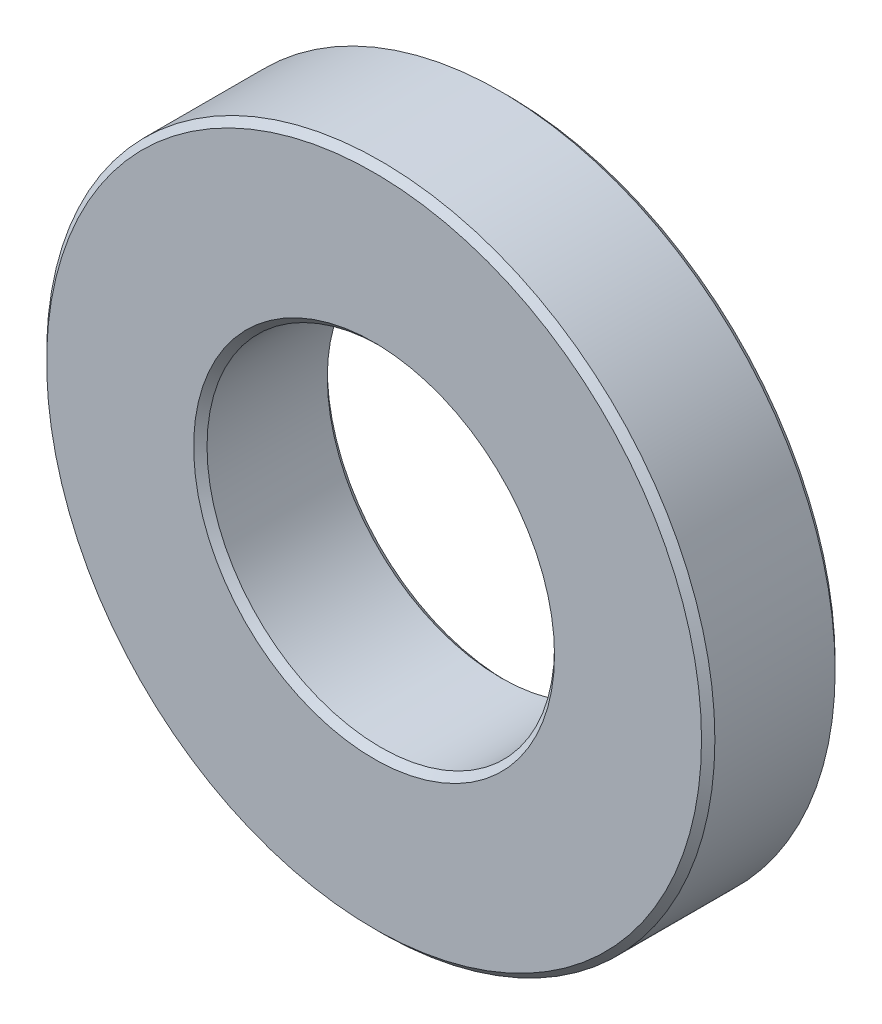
from build123d import *

# Parameters (mm, degrees)
SKETCH1_R           = 5
SKETCH1_R_2         = 2.6
BOSS_EXTRUDE2_DEPTH = 1
CHAMFER3_SIZE       = 0.1


with BuildPart() as part:
    # Sketch1 → Boss-Extrude2 (new, symmetric)
    with BuildSketch(Plane.XY):
        Circle(SKETCH1_R)
        Circle(SKETCH1_R_2, mode=Mode.SUBTRACT)
    extrude(amount=BOSS_EXTRUDE2_DEPTH, both=True)

    # Chamfer3
    chamfer3_edges = [part.edges().sort_by_distance(p)[0] for p in [
        (-5, 0, -1),
        (-5, 0, 1),
        (-2.6, 0, -1),
        (-2.6, 0, 1),
    ]]
    chamfer(chamfer3_edges, length=CHAMFER3_SIZE)


solid = part.part
